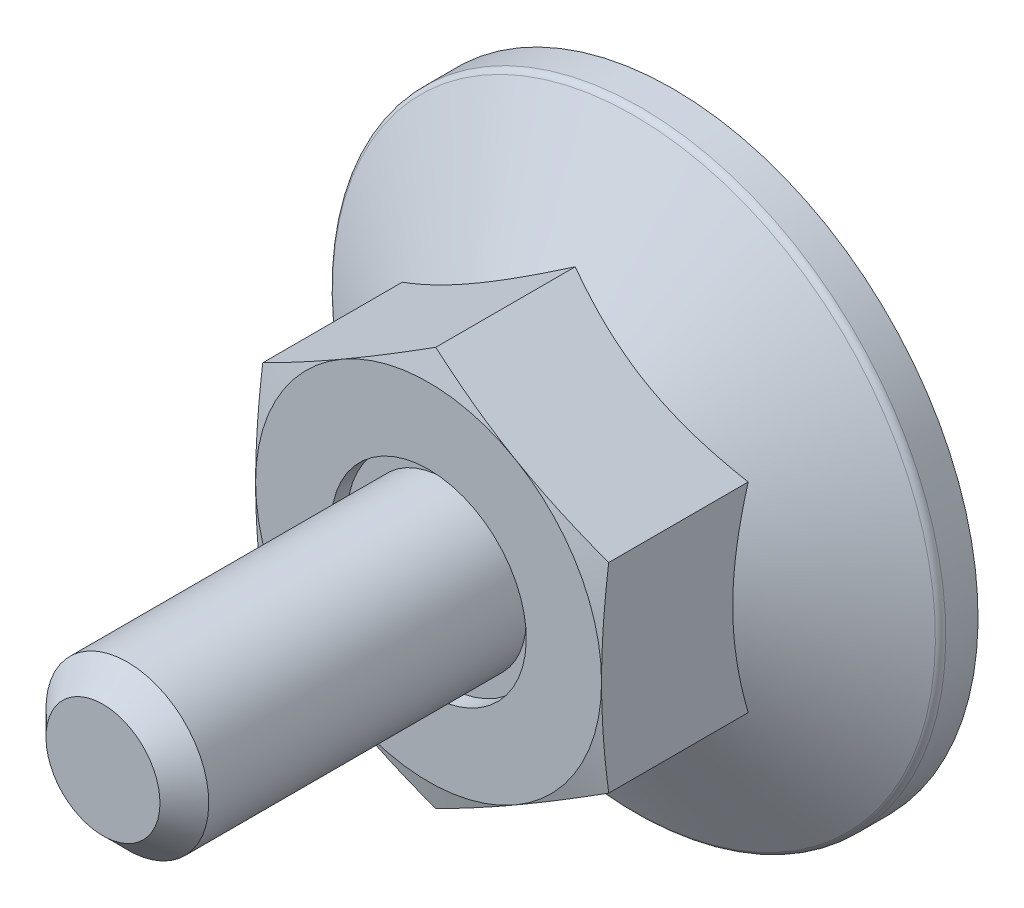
ISO-10303-21;
HEADER;
FILE_DESCRIPTION(('STEP AP214'),'2;1');
FILE_NAME('part.step','',(''),(''),'','','');
FILE_SCHEMA(('AUTOMOTIVE_DESIGN { 1 0 10303 214 1 1 1 1 }'));
ENDSEC;
DATA;
#1=APPLICATION_CONTEXT('core data for automotive mechanical design processes');
#2=APPLICATION_PROTOCOL_DEFINITION('international standard','automotive_design',2000,#1);
#3=PRODUCT_CONTEXT('',#1,'mechanical');
#4=PRODUCT('Part','Part','',(#3));
#5=PRODUCT_RELATED_PRODUCT_CATEGORY('part','',(#4));
#6=PRODUCT_DEFINITION_FORMATION('','',#4);
#7=PRODUCT_DEFINITION_CONTEXT('part definition',#1,'design');
#8=PRODUCT_DEFINITION('design','',#6,#7);
#9=PRODUCT_DEFINITION_SHAPE('','',#8);
#10=(LENGTH_UNIT() NAMED_UNIT(*) SI_UNIT(.MILLI.,.METRE.));
#11=(NAMED_UNIT(*) PLANE_ANGLE_UNIT() SI_UNIT($,.RADIAN.));
#12=(NAMED_UNIT(*) SI_UNIT($,.STERADIAN.) SOLID_ANGLE_UNIT());
#13=UNCERTAINTY_MEASURE_WITH_UNIT(LENGTH_MEASURE(1.E-05),#10,'distance_accuracy_value','');
#14=(GEOMETRIC_REPRESENTATION_CONTEXT(3) GLOBAL_UNCERTAINTY_ASSIGNED_CONTEXT((#13)) GLOBAL_UNIT_ASSIGNED_CONTEXT((#10,
#11,#12)) REPRESENTATION_CONTEXT('',''));
#15=CARTESIAN_POINT('',(0.,0.,0.));
#16=DIRECTION('',(0.,0.,1.));
#17=DIRECTION('',(1.,0.,0.));
#18=AXIS2_PLACEMENT_3D('',#15,#16,#17);
#19=CARTESIAN_POINT('',(0.,0.,11.2));
#20=DIRECTION('',(0.,0.,-1.));
#21=DIRECTION('',(0.,1.,0.));
#22=AXIS2_PLACEMENT_3D('',#19,#20,#21);
#23=PLANE('',#22);
#24=CARTESIAN_POINT('',(0.,0.,11.2));
#25=DIRECTION('',(0.,0.,-1.));
#26=DIRECTION('',(0.,1.,0.));
#27=AXIS2_PLACEMENT_3D('',#24,#25,#26);
#28=CIRCLE('',#27,4.8);
#29=CARTESIAN_POINT('',(0.,4.8,11.2));
#30=VERTEX_POINT('',#29);
#31=EDGE_CURVE('E108',#30,#30,#28,.T.);
#32=ORIENTED_EDGE('',*,*,#31,.F.);
#33=EDGE_LOOP('',(#32));
#34=FACE_BOUND('',#33,.T.);
#35=CARTESIAN_POINT('',(0.,0.,11.2));
#36=DIRECTION('',(0.,0.,-1.));
#37=DIRECTION('',(0.,1.,0.));
#38=AXIS2_PLACEMENT_3D('',#35,#36,#37);
#39=CIRCLE('',#38,4.);
#40=CARTESIAN_POINT('',(0.,4.,11.2));
#41=VERTEX_POINT('',#40);
#42=EDGE_CURVE('E259',#41,#41,#39,.F.);
#43=ORIENTED_EDGE('',*,*,#42,.F.);
#44=EDGE_LOOP('',(#43));
#45=FACE_BOUND('',#44,.T.);
#46=ADVANCED_FACE('F14',(#34,#45),#23,.F.);
#47=CARTESIAN_POINT('',(0.,9.81495457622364,32.));
#48=DIRECTION('',(0.5,-0.866025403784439,0.));
#49=DIRECTION('',(0.866025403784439,0.5,0.));
#50=AXIS2_PLACEMENT_3D('',#47,#48,#49);
#51=PLANE('',#50);
#52=CARTESIAN_POINT('',(-8.5002,4.90736181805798,4.7935207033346));
#53=CARTESIAN_POINT('',(-8.31336077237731,5.01523349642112,4.85579061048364));
#54=CARTESIAN_POINT('',(-8.1258249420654,5.1235073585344,4.91523445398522));
#55=CARTESIAN_POINT('',(-7.74923024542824,5.34093440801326,5.02769163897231));
#56=CARTESIAN_POINT('',(-7.56017075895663,5.45008795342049,5.08070220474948));
#57=CARTESIAN_POINT('',(-6.9899652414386,5.77929626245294,5.22904336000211));
#58=CARTESIAN_POINT('',(-6.60656835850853,6.00065055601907,5.31341782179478));
#59=CARTESIAN_POINT('',(-6.03282233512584,6.33190297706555,5.41235673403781));
#60=CARTESIAN_POINT('',(-5.84418723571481,6.44081150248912,5.44054155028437));
#61=CARTESIAN_POINT('',(-5.46606397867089,6.65912106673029,5.48780266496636));
#62=CARTESIAN_POINT('',(-5.27657589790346,6.76852206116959,5.5068797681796));
#63=CARTESIAN_POINT('',(-4.8972734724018,6.98751241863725,5.53544197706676));
#64=CARTESIAN_POINT('',(-4.70745974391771,7.09710142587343,5.54493796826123));
#65=CARTESIAN_POINT('',(-4.32765694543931,7.3163806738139,5.55413437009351));
#66=CARTESIAN_POINT('',(-4.13766788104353,7.42607091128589,5.55383508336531));
#67=CARTESIAN_POINT('',(-3.78247698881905,7.63114046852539,5.54412227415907));
#68=CARTESIAN_POINT('',(-3.6172500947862,7.72653426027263,5.53589358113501));
#69=CARTESIAN_POINT('',(-3.28718328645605,7.9170984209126,5.51218750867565));
#70=CARTESIAN_POINT('',(-3.12234339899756,8.01226877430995,5.49670964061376));
#71=CARTESIAN_POINT('',(-2.62846189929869,8.29741139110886,5.43976812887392));
#72=CARTESIAN_POINT('',(-2.30029449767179,8.48687892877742,5.38780368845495));
#73=CARTESIAN_POINT('',(-1.64047857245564,8.86782383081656,5.25789180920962));
#74=CARTESIAN_POINT('',(-1.30891425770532,9.05925257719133,5.17939367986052));
#75=CARTESIAN_POINT('',(-0.650730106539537,9.43925537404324,5.00123540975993));
#76=CARTESIAN_POINT('',(-0.32410184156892,9.62783429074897,4.90161711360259));
#77=CARTESIAN_POINT('',(0.000200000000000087,9.81507004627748,4.7935207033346));
#78=B_SPLINE_CURVE_WITH_KNOTS('',3,(#52,#53,#54,#55,#56,#57,#58,#59,#60,#61,#62,#63,#64,#65,#66,
#67,#68,#69,#70,#71,#72,#73,#74,#75,#76,#77),.UNSPECIFIED.,.F.,.F.,(4,2,2,2,2,2,2,2,2,2,2,2,4),
(0.,0.673596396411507,1.34748239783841,2.69805431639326,3.356799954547,4.01548737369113,
4.67342558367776,5.33134346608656,5.90409556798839,6.47688628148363,7.62328361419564,
8.79510569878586,9.9646274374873),.UNSPECIFIED.);
#79=CARTESIAN_POINT('',(-8.5,4.90747728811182,4.79358737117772));
#80=VERTEX_POINT('',#79);
#81=CARTESIAN_POINT('',(0.,9.81495457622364,4.79358737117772));
#82=VERTEX_POINT('',#81);
#83=EDGE_CURVE('E97',#80,#82,#78,.T.);
#84=ORIENTED_EDGE('',*,*,#83,.F.);
#85=DIRECTION('',(0.,0.,-1.));
#86=VECTOR('',#85,1.);
#87=CARTESIAN_POINT('',(-8.5,4.90747728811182,32.));
#88=LINE('',#87,#86);
#89=CARTESIAN_POINT('',(-8.5,4.90747728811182,11.6476589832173));
#90=VERTEX_POINT('',#89);
#91=EDGE_CURVE('E86',#90,#80,#88,.T.);
#92=ORIENTED_EDGE('',*,*,#91,.F.);
#93=CARTESIAN_POINT('',(0.000200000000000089,9.81507004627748,11.6476280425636));
#94=CARTESIAN_POINT('',(-0.352800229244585,9.61126526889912,11.7022599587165));
#95=CARTESIAN_POINT('',(-0.706440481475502,9.40709097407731,11.7518566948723));
#96=CARTESIAN_POINT('',(-1.41496987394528,8.99802133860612,11.8389934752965));
#97=CARTESIAN_POINT('',(-1.76985946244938,8.79312573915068,11.8765286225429));
#98=CARTESIAN_POINT('',(-2.47873586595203,8.38385575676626,11.9373509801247));
#99=CARTESIAN_POINT('',(-2.83271788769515,8.17948414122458,11.9607107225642));
#100=CARTESIAN_POINT('',(-3.5411333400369,7.77048028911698,11.9920337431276));
#101=CARTESIAN_POINT('',(-3.89556667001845,7.56584811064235,12.));
#102=CARTESIAN_POINT('',(-4.60443332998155,7.15658375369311,12.));
#103=CARTESIAN_POINT('',(-4.9588666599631,6.95195157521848,11.9920337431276));
#104=CARTESIAN_POINT('',(-5.66728211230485,6.54294772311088,11.9607107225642));
#105=CARTESIAN_POINT('',(-6.02126413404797,6.33857610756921,11.9373509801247));
#106=CARTESIAN_POINT('',(-6.73014053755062,5.92930612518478,11.8765286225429));
#107=CARTESIAN_POINT('',(-7.08503012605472,5.72441052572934,11.8389934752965));
#108=CARTESIAN_POINT('',(-7.7935595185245,5.31534089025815,11.7518566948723));
#109=CARTESIAN_POINT('',(-8.14719977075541,5.11116659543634,11.7022599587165));
#110=CARTESIAN_POINT('',(-8.5002,4.90736181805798,11.6476280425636));
#111=B_SPLINE_CURVE_WITH_KNOTS('',3,(#93,#94,#95,#96,#97,#98,#99,#100,#101,#102,#103,#104,#105,
#106,#107,#108,#109,#110),.UNSPECIFIED.,.F.,.F.,(4,2,2,2,2,2,2,2,4),(0.,1.23382789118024,
2.46815608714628,3.69611406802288,4.92383440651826,6.15155474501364,7.37951272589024,
8.61384092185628,9.84766881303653),.UNSPECIFIED.);
#112=CARTESIAN_POINT('',(-4.25,7.36121593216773,12.));
#113=VERTEX_POINT('',#112);
#114=EDGE_CURVE('E186',#113,#90,#111,.T.);
#115=ORIENTED_EDGE('',*,*,#114,.F.);
#116=CARTESIAN_POINT('',(0.,9.81495457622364,11.6476589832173));
#117=VERTEX_POINT('',#116);
#118=EDGE_CURVE('E318',#117,#113,#111,.T.);
#119=ORIENTED_EDGE('',*,*,#118,.F.);
#120=DIRECTION('',(0.,0.,-1.));
#121=VECTOR('',#120,1.);
#122=CARTESIAN_POINT('',(0.,9.81495457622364,32.));
#123=LINE('',#122,#121);
#124=EDGE_CURVE('E101',#117,#82,#123,.T.);
#125=ORIENTED_EDGE('',*,*,#124,.T.);
#126=EDGE_LOOP('',(#84,#92,#115,#119,#125));
#127=FACE_BOUND('',#126,.T.);
#128=ADVANCED_FACE('F100',(#127),#51,.F.);
#129=CARTESIAN_POINT('',(8.5,4.90747728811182,32.));
#130=DIRECTION('',(-0.5,-0.866025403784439,0.));
#131=DIRECTION('',(0.866025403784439,-0.5,0.));
#132=AXIS2_PLACEMENT_3D('',#129,#130,#131);
#133=PLANE('',#132);
#134=CARTESIAN_POINT('',(-0.0002,9.81507004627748,4.7935207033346));
#135=CARTESIAN_POINT('',(0.186639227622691,9.70719836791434,4.85579061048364));
#136=CARTESIAN_POINT('',(0.374175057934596,9.59892450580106,4.91523445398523));
#137=CARTESIAN_POINT('',(0.750769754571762,9.3814974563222,5.02769163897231));
#138=CARTESIAN_POINT('',(0.939829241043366,9.27234391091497,5.08070220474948));
#139=CARTESIAN_POINT('',(1.5100347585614,8.94313560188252,5.22904336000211));
#140=CARTESIAN_POINT('',(1.89343164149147,8.72178130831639,5.31341782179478));
#141=CARTESIAN_POINT('',(2.46717766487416,8.39052888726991,5.41235673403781));
#142=CARTESIAN_POINT('',(2.65581276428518,8.28162036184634,5.44054155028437));
#143=CARTESIAN_POINT('',(3.03393602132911,8.06331079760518,5.48780266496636));
#144=CARTESIAN_POINT('',(3.22342410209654,7.95390980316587,5.5068797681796));
#145=CARTESIAN_POINT('',(3.6027265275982,7.73491944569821,5.53544197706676));
#146=CARTESIAN_POINT('',(3.79254025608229,7.62533043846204,5.54493796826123));
#147=CARTESIAN_POINT('',(4.17234305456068,7.40605119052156,5.55413437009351));
#148=CARTESIAN_POINT('',(4.36233211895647,7.29636095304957,5.55383508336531));
#149=CARTESIAN_POINT('',(4.71752301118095,7.09129139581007,5.54412227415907));
#150=CARTESIAN_POINT('',(4.8827499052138,6.99589760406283,5.53589358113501));
#151=CARTESIAN_POINT('',(5.21281671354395,6.80533344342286,5.51218750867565));
#152=CARTESIAN_POINT('',(5.37765660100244,6.71016309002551,5.49670964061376));
#153=CARTESIAN_POINT('',(5.87153810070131,6.42502047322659,5.43976812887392));
#154=CARTESIAN_POINT('',(6.19970550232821,6.23555293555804,5.38780368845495));
#155=CARTESIAN_POINT('',(6.85952142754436,5.8546080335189,5.25789180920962));
#156=CARTESIAN_POINT('',(7.19108574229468,5.66317928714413,5.17939367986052));
#157=CARTESIAN_POINT('',(7.84926989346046,5.28317649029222,5.00123540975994));
#158=CARTESIAN_POINT('',(8.17589815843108,5.09459757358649,4.90161711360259));
#159=CARTESIAN_POINT('',(8.5002,4.90736181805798,4.7935207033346));
#160=B_SPLINE_CURVE_WITH_KNOTS('',3,(#134,#135,#136,#137,#138,#139,#140,#141,#142,#143,#144,
#145,#146,#147,#148,#149,#150,#151,#152,#153,#154,#155,#156,#157,#158,#159),.UNSPECIFIED.,.F.,
.F.,(4,2,2,2,2,2,2,2,2,2,2,2,4),(0.,0.673596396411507,1.34748239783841,2.69805431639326,
3.356799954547,4.01548737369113,4.67342558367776,5.33134346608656,5.90409556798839,
6.47688628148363,7.62328361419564,8.79510569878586,9.9646274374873),.UNSPECIFIED.);
#161=CARTESIAN_POINT('',(8.5,4.90747728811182,4.79358737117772));
#162=VERTEX_POINT('',#161);
#163=EDGE_CURVE('E29',#82,#162,#160,.T.);
#164=ORIENTED_EDGE('',*,*,#163,.F.);
#165=ORIENTED_EDGE('',*,*,#124,.F.);
#166=CARTESIAN_POINT('',(8.5002,4.90736181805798,11.6476280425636));
#167=CARTESIAN_POINT('',(8.14719977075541,5.11116659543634,11.7022599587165));
#168=CARTESIAN_POINT('',(7.7935595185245,5.31534089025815,11.7518566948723));
#169=CARTESIAN_POINT('',(7.08503012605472,5.72441052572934,11.8389934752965));
#170=CARTESIAN_POINT('',(6.73014053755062,5.92930612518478,11.8765286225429));
#171=CARTESIAN_POINT('',(6.02126413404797,6.33857610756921,11.9373509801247));
#172=CARTESIAN_POINT('',(5.66728211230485,6.54294772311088,11.9607107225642));
#173=CARTESIAN_POINT('',(4.9588666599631,6.95195157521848,11.9920337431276));
#174=CARTESIAN_POINT('',(4.60443332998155,7.15658375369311,12.));
#175=CARTESIAN_POINT('',(3.89556667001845,7.56584811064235,12.));
#176=CARTESIAN_POINT('',(3.5411333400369,7.77048028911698,11.9920337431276));
#177=CARTESIAN_POINT('',(2.83271788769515,8.17948414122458,11.9607107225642));
#178=CARTESIAN_POINT('',(2.47873586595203,8.38385575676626,11.9373509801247));
#179=CARTESIAN_POINT('',(1.76985946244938,8.79312573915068,11.8765286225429));
#180=CARTESIAN_POINT('',(1.41496987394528,8.99802133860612,11.8389934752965));
#181=CARTESIAN_POINT('',(0.706440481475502,9.40709097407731,11.7518566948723));
#182=CARTESIAN_POINT('',(0.352800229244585,9.61126526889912,11.7022599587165));
#183=CARTESIAN_POINT('',(-0.000200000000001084,9.81507004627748,11.6476280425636));
#184=B_SPLINE_CURVE_WITH_KNOTS('',3,(#166,#167,#168,#169,#170,#171,#172,#173,#174,#175,#176,
#177,#178,#179,#180,#181,#182,#183),.UNSPECIFIED.,.F.,.F.,(4,2,2,2,2,2,2,2,4),(0.,
1.23382789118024,2.46815608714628,3.69611406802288,4.92383440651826,6.15155474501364,
7.37951272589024,8.61384092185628,9.84766881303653),.UNSPECIFIED.);
#185=CARTESIAN_POINT('',(4.25,7.36121593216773,12.));
#186=VERTEX_POINT('',#185);
#187=EDGE_CURVE('E177',#186,#117,#184,.T.);
#188=ORIENTED_EDGE('',*,*,#187,.F.);
#189=CARTESIAN_POINT('',(8.5,4.90747728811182,11.6476589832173));
#190=VERTEX_POINT('',#189);
#191=EDGE_CURVE('E184',#190,#186,#184,.T.);
#192=ORIENTED_EDGE('',*,*,#191,.F.);
#193=DIRECTION('',(0.,0.,-1.));
#194=VECTOR('',#193,1.);
#195=CARTESIAN_POINT('',(8.5,4.90747728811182,32.));
#196=LINE('',#195,#194);
#197=EDGE_CURVE('E216',#190,#162,#196,.T.);
#198=ORIENTED_EDGE('',*,*,#197,.T.);
#199=EDGE_LOOP('',(#164,#165,#188,#192,#198));
#200=FACE_BOUND('',#199,.T.);
#201=ADVANCED_FACE('F192',(#200),#133,.F.);
#202=CARTESIAN_POINT('',(8.5,-4.90747728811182,32.));
#203=DIRECTION('',(-1.,0.,0.));
#204=DIRECTION('',(0.,-1.,0.));
#205=AXIS2_PLACEMENT_3D('',#202,#203,#204);
#206=PLANE('',#205);
#207=CARTESIAN_POINT('',(8.5,13.0314294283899,1.47752704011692));
#208=CARTESIAN_POINT('',(8.5,12.6612665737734,1.65647774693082));
#209=CARTESIAN_POINT('',(8.5,12.290237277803,1.83366776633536));
#210=CARTESIAN_POINT('',(8.5,11.5459841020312,2.1835324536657));
#211=CARTESIAN_POINT('',(8.5,11.1727598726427,2.3562063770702));
#212=CARTESIAN_POINT('',(8.5,10.4216603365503,2.69694543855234));
#213=CARTESIAN_POINT('',(8.5,10.0437706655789,2.86497902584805));
#214=CARTESIAN_POINT('',(8.5,9.2849306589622,3.19396010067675));
#215=CARTESIAN_POINT('',(8.5,8.90398047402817,3.35490793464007));
#216=CARTESIAN_POINT('',(8.5,8.12702308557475,3.67249615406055));
#217=CARTESIAN_POINT('',(8.5,7.73090483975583,3.82886642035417));
#218=CARTESIAN_POINT('',(8.5,6.93398073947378,4.12940330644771));
#219=CARTESIAN_POINT('',(8.5,6.53317435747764,4.27356853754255));
#220=CARTESIAN_POINT('',(8.5,5.72703031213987,4.54580160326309));
#221=CARTESIAN_POINT('',(8.5,5.32170421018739,4.67390329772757));
#222=CARTESIAN_POINT('',(8.5,4.50525785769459,4.90980359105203));
#223=CARTESIAN_POINT('',(8.5,4.09413952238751,5.01760873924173));
#224=CARTESIAN_POINT('',(8.5,3.26789885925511,5.20711197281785));
#225=CARTESIAN_POINT('',(8.5,2.85280627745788,5.28893618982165));
#226=CARTESIAN_POINT('',(8.5,2.22651264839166,5.38853539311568));
#227=CARTESIAN_POINT('',(8.5,2.01712321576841,5.41788026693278));
#228=CARTESIAN_POINT('',(8.5,1.59735566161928,5.46827917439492));
#229=CARTESIAN_POINT('',(8.5,1.38697763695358,5.48933400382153));
#230=CARTESIAN_POINT('',(8.5,0.968196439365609,5.52247691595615));
#231=CARTESIAN_POINT('',(8.5,0.759802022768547,5.53467524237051));
#232=CARTESIAN_POINT('',(8.5,0.342684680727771,5.55026003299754));
#233=CARTESIAN_POINT('',(8.5,0.133961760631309,5.5536466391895));
#234=CARTESIAN_POINT('',(8.5,-0.283445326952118,5.55152742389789));
#235=CARTESIAN_POINT('',(8.5,-0.492129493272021,5.546021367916));
#236=CARTESIAN_POINT('',(8.5,-0.909085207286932,5.52624824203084));
#237=CARTESIAN_POINT('',(8.5,-1.11735673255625,5.51198070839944));
#238=CARTESIAN_POINT('',(8.5,-1.62231800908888,5.46706351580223));
#239=CARTESIAN_POINT('',(8.5,-1.91862399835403,5.43201243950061));
#240=CARTESIAN_POINT('',(8.5,-2.50892471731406,5.34612267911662));
#241=CARTESIAN_POINT('',(8.5,-2.80291910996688,5.29528173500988));
#242=CARTESIAN_POINT('',(8.5,-3.68114216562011,5.12178025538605));
#243=CARTESIAN_POINT('',(8.5,-4.26128126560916,4.97817413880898));
#244=CARTESIAN_POINT('',(8.5,-5.12903133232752,4.73045572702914));
#245=CARTESIAN_POINT('',(8.5,-5.42116721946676,4.64129591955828));
#246=CARTESIAN_POINT('',(8.5,-6.0025970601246,4.45406394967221));
#247=CARTESIAN_POINT('',(8.5,-6.29189099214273,4.35599171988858));
#248=CARTESIAN_POINT('',(8.5,-6.86774141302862,4.15248019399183));
#249=CARTESIAN_POINT('',(8.5,-7.15429879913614,4.0470434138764));
#250=CARTESIAN_POINT('',(8.5,-7.72505625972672,3.83000899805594));
#251=CARTESIAN_POINT('',(8.5,-8.00925638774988,3.71841150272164));
#252=CARTESIAN_POINT('',(8.5,-8.7865968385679,3.40502511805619));
#253=CARTESIAN_POINT('',(8.5,-9.2776226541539,3.197996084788));
#254=CARTESIAN_POINT('',(8.5,-10.2546964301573,2.77246752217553));
#255=CARTESIAN_POINT('',(8.5,-10.7407438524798,2.55396676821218));
#256=CARTESIAN_POINT('',(8.5,-11.7090438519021,2.108282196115));
#257=CARTESIAN_POINT('',(8.5,-12.1912949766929,1.88109523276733));
#258=CARTESIAN_POINT('',(8.5,-13.1526185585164,1.42016244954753));
#259=CARTESIAN_POINT('',(8.5,-13.6316911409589,1.18641689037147));
#260=CARTESIAN_POINT('',(8.5,-14.588034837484,0.713462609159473));
#261=CARTESIAN_POINT('',(8.5,-15.0653020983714,0.47424611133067));
#262=CARTESIAN_POINT('',(8.5,-16.0177905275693,-0.00822936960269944));
#263=CARTESIAN_POINT('',(8.5,-16.4930116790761,-0.251488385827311));
#264=CARTESIAN_POINT('',(8.5,-17.4416812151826,-0.741191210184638));
#265=CARTESIAN_POINT('',(8.5,-17.9151299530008,-0.987634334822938));
#266=CARTESIAN_POINT('',(8.5,-18.8606492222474,-1.48315179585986));
#267=CARTESIAN_POINT('',(8.5,-19.3327197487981,-1.73222614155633));
#268=CARTESIAN_POINT('',(8.5,-20.6461392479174,-2.42904815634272));
#269=CARTESIAN_POINT('',(8.5,-21.4862394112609,-2.87914918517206));
#270=CARTESIAN_POINT('',(8.5,-23.1638169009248,-3.78432075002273));
#271=CARTESIAN_POINT('',(8.5,-24.0012940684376,-4.23939157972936));
#272=CARTESIAN_POINT('',(8.5,-25.671623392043,-5.15180725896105));
#273=CARTESIAN_POINT('',(8.5,-26.5044818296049,-5.60914061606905));
#274=CARTESIAN_POINT('',(8.5,-27.7525740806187,-6.29723391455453));
#275=CARTESIAN_POINT('',(8.5,-28.1683903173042,-6.52693873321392));
#276=CARTESIAN_POINT('',(8.5,-28.9996764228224,-6.98697325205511));
#277=CARTESIAN_POINT('',(8.5,-29.4151462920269,-7.21730295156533));
#278=CARTESIAN_POINT('',(8.5,-29.8304643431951,-7.44790614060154));
#279=B_SPLINE_CURVE_WITH_KNOTS('',3,(#207,#208,#209,#210,#211,#212,#213,#214,#215,#216,#217,
#218,#219,#220,#221,#222,#223,#224,#225,#226,#227,#228,#229,#230,#231,#232,#233,#234,#235,#236,
#237,#238,#239,#240,#241,#242,#243,#244,#245,#246,#247,#248,#249,#250,#251,#252,#253,#254,#255,
#256,#257,#258,#259,#260,#261,#262,#263,#264,#265,#266,#267,#268,#269,#270,#271,#272,#273,#274,
#275,#276,#277,#278),.UNSPECIFIED.,.F.,.F.,(4,2,2,2,2,2,2,2,2,2,2,2,2,2,2,2,2,2,2,2,2,2,2,2,2,2,
2,2,2,2,2,2,2,2,2,4),(0.,1.23346428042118,2.46713064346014,3.70776702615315,4.94834268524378,
6.22578289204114,7.5033682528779,8.77821366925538,10.0526470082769,11.32079515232,
11.9549638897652,12.5890717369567,13.2151443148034,13.8412068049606,14.4672858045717,
15.0933979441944,15.9880059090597,16.8827419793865,18.6732029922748,19.5894472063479,
20.5056983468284,21.4216379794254,22.3375567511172,23.9359919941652,25.5345982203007,
27.1337888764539,28.7329160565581,30.3344778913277,31.9360528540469,33.5372895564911,
35.1385319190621,37.9977422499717,40.8571224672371,43.7075995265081,45.1327331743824,
46.5578652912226),.UNSPECIFIED.);
#280=CARTESIAN_POINT('',(8.5,-4.90747728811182,4.79358737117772));
#281=VERTEX_POINT('',#280);
#282=EDGE_CURVE('E37',#162,#281,#279,.T.);
#283=ORIENTED_EDGE('',*,*,#282,.F.);
#284=ORIENTED_EDGE('',*,*,#197,.F.);
#285=CARTESIAN_POINT('',(8.5,12.9820891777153,10.1197370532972));
#286=CARTESIAN_POINT('',(8.5,12.5964686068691,10.2061594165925));
#287=CARTESIAN_POINT('',(8.5,12.2106068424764,10.2915248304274));
#288=CARTESIAN_POINT('',(8.5,11.4382824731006,10.4595712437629));
#289=CARTESIAN_POINT('',(8.5,11.0518198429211,10.5422521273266));
#290=CARTESIAN_POINT('',(8.5,10.2778290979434,10.7044309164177));
#291=CARTESIAN_POINT('',(8.5,9.89030030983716,10.7839256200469));
#292=CARTESIAN_POINT('',(8.5,9.11443612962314,10.9388739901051));
#293=CARTESIAN_POINT('',(8.5,8.72610074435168,11.0143276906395));
#294=CARTESIAN_POINT('',(8.5,7.95158013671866,11.159650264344));
#295=CARTESIAN_POINT('',(8.5,7.56540239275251,11.2295587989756));
#296=CARTESIAN_POINT('',(8.5,6.79199352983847,11.3632725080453));
#297=CARTESIAN_POINT('',(8.5,6.40476243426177,11.4270778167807));
#298=CARTESIAN_POINT('',(8.5,5.62917169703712,11.54714843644));
#299=CARTESIAN_POINT('',(8.5,5.24081220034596,11.6034146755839));
#300=CARTESIAN_POINT('',(8.5,4.46285737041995,11.70674908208));
#301=CARTESIAN_POINT('',(8.5,4.07326203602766,11.7538172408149));
#302=CARTESIAN_POINT('',(8.5,3.28844017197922,11.8374226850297));
#303=CARTESIAN_POINT('',(8.5,2.89320002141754,11.8738340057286));
#304=CARTESIAN_POINT('',(8.5,2.10172608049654,11.9336139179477));
#305=CARTESIAN_POINT('',(8.5,1.70549231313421,11.9569828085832));
#306=CARTESIAN_POINT('',(8.5,0.91260591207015,11.9893148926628));
#307=CARTESIAN_POINT('',(8.5,0.515953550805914,11.9982846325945));
#308=CARTESIAN_POINT('',(8.5,-0.277408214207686,12.0012669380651));
#309=CARTESIAN_POINT('',(8.5,-0.674117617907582,11.9952795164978));
#310=CARTESIAN_POINT('',(8.5,-1.46847963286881,11.9686842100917));
#311=CARTESIAN_POINT('',(8.5,-1.86613043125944,11.9480232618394));
#312=CARTESIAN_POINT('',(8.5,-2.66049684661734,11.8932602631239));
#313=CARTESIAN_POINT('',(8.5,-3.05721244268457,11.8591579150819));
#314=CARTESIAN_POINT('',(8.5,-3.84970511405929,11.7792347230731));
#315=CARTESIAN_POINT('',(8.5,-4.24548140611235,11.7334062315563));
#316=CARTESIAN_POINT('',(8.5,-5.03576028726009,11.6319377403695));
#317=CARTESIAN_POINT('',(8.5,-5.43026287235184,11.5762977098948));
#318=CARTESIAN_POINT('',(8.5,-6.19195385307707,11.4609360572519));
#319=CARTESIAN_POINT('',(8.5,-6.55922094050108,11.4017287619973));
#320=CARTESIAN_POINT('',(8.5,-7.29278719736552,11.2775674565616));
#321=CARTESIAN_POINT('',(8.5,-7.65908634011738,11.2126132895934));
#322=CARTESIAN_POINT('',(8.5,-8.39085027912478,11.078008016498));
#323=CARTESIAN_POINT('',(8.5,-8.75631499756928,11.0083564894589));
#324=CARTESIAN_POINT('',(8.5,-9.48649515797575,10.8652200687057));
#325=CARTESIAN_POINT('',(8.5,-9.85121059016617,10.7917351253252));
#326=CARTESIAN_POINT('',(8.5,-10.5800753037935,10.6416087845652));
#327=CARTESIAN_POINT('',(8.5,-10.944224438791,10.5649666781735));
#328=CARTESIAN_POINT('',(8.5,-11.6719684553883,10.4090909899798));
#329=CARTESIAN_POINT('',(8.5,-12.0355633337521,10.3298573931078));
#330=CARTESIAN_POINT('',(8.5,-13.1255915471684,10.0889686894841));
#331=CARTESIAN_POINT('',(8.5,-13.8513178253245,9.92411536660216));
#332=CARTESIAN_POINT('',(8.5,-15.2942598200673,9.59010912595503));
#333=CARTESIAN_POINT('',(8.5,-16.0114890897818,9.42101437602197));
#334=CARTESIAN_POINT('',(8.5,-17.4449475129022,9.07858755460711));
#335=CARTESIAN_POINT('',(8.5,-18.1611766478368,8.90525540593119));
#336=CARTESIAN_POINT('',(8.5,-19.5919856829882,8.5556799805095));
#337=CARTESIAN_POINT('',(8.5,-20.306566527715,8.37944056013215));
#338=CARTESIAN_POINT('',(8.5,-21.7351057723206,8.02455520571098));
#339=CARTESIAN_POINT('',(8.5,-22.4490641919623,7.8459093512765));
#340=CARTESIAN_POINT('',(8.5,-23.1628057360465,7.66641079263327));
#341=B_SPLINE_CURVE_WITH_KNOTS('',3,(#285,#286,#287,#288,#289,#290,#291,#292,#293,#294,#295,
#296,#297,#298,#299,#300,#301,#302,#303,#304,#305,#306,#307,#308,#309,#310,#311,#312,#313,#314,
#315,#316,#317,#318,#319,#320,#321,#322,#323,#324,#325,#326,#327,#328,#329,#330,#331,#332,#333,
#334,#335,#336,#337,#338,#339,#340),.UNSPECIFIED.,.F.,.F.,(4,2,2,2,2,2,2,2,2,2,2,2,2,2,2,2,2,2,
2,2,2,2,2,2,2,2,2,4),(0.,1.18556310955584,2.37117735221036,3.55795462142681,4.74472187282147,
5.92204594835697,7.09934411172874,8.27649719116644,9.45365137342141,10.6442044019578,
11.8347301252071,13.0247144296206,14.2146977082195,15.4090063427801,16.6033414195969,
17.7984574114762,18.9935771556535,20.1095500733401,21.2255534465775,22.3416569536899,
23.4577749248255,24.5741449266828,25.6905214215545,27.9231231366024,30.1337863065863,
32.3444897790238,34.5524651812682,36.7603677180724),.UNSPECIFIED.);
#342=CARTESIAN_POINT('',(8.5,0.,12.));
#343=VERTEX_POINT('',#342);
#344=EDGE_CURVE('E170',#343,#190,#341,.F.);
#345=ORIENTED_EDGE('',*,*,#344,.F.);
#346=CARTESIAN_POINT('',(8.5,-4.90747728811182,11.6476589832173));
#347=VERTEX_POINT('',#346);
#348=EDGE_CURVE('E185',#347,#343,#341,.F.);
#349=ORIENTED_EDGE('',*,*,#348,.F.);
#350=DIRECTION('',(0.,0.,-1.));
#351=VECTOR('',#350,1.);
#352=CARTESIAN_POINT('',(8.5,-4.90747728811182,32.));
#353=LINE('',#352,#351);
#354=EDGE_CURVE('E218',#347,#281,#353,.T.);
#355=ORIENTED_EDGE('',*,*,#354,.T.);
#356=EDGE_LOOP('',(#283,#284,#345,#349,#355));
#357=FACE_BOUND('',#356,.T.);
#358=ADVANCED_FACE('F195',(#357),#206,.F.);
#359=CARTESIAN_POINT('',(0.,-9.81495457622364,32.));
#360=DIRECTION('',(-0.5,0.866025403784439,0.));
#361=DIRECTION('',(-0.866025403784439,-0.5,0.));
#362=AXIS2_PLACEMENT_3D('',#359,#360,#361);
#363=PLANE('',#362);
#364=CARTESIAN_POINT('',(8.5002,-4.90736181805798,4.7935207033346));
#365=CARTESIAN_POINT('',(8.31336077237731,-5.01523349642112,4.85579061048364));
#366=CARTESIAN_POINT('',(8.1258249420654,-5.1235073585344,4.91523445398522));
#367=CARTESIAN_POINT('',(7.74923024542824,-5.34093440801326,5.02769163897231));
#368=CARTESIAN_POINT('',(7.56017075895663,-5.45008795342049,5.08070220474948));
#369=CARTESIAN_POINT('',(6.9899652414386,-5.77929626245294,5.22904336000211));
#370=CARTESIAN_POINT('',(6.60656835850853,-6.00065055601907,5.31341782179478));
#371=CARTESIAN_POINT('',(6.03282233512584,-6.33190297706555,5.41235673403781));
#372=CARTESIAN_POINT('',(5.84418723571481,-6.44081150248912,5.44054155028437));
#373=CARTESIAN_POINT('',(5.46606397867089,-6.65912106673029,5.48780266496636));
#374=CARTESIAN_POINT('',(5.27657589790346,-6.76852206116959,5.5068797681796));
#375=CARTESIAN_POINT('',(4.8972734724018,-6.98751241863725,5.53544197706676));
#376=CARTESIAN_POINT('',(4.70745974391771,-7.09710142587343,5.54493796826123));
#377=CARTESIAN_POINT('',(4.32765694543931,-7.3163806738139,5.55413437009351));
#378=CARTESIAN_POINT('',(4.13766788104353,-7.42607091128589,5.55383508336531));
#379=CARTESIAN_POINT('',(3.78247698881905,-7.63114046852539,5.54412227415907));
#380=CARTESIAN_POINT('',(3.6172500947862,-7.72653426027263,5.53589358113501));
#381=CARTESIAN_POINT('',(3.28718328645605,-7.9170984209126,5.51218750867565));
#382=CARTESIAN_POINT('',(3.12234339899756,-8.01226877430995,5.49670964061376));
#383=CARTESIAN_POINT('',(2.62846189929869,-8.29741139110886,5.43976812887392));
#384=CARTESIAN_POINT('',(2.30029449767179,-8.48687892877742,5.38780368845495));
#385=CARTESIAN_POINT('',(1.64047857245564,-8.86782383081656,5.25789180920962));
#386=CARTESIAN_POINT('',(1.30891425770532,-9.05925257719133,5.17939367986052));
#387=CARTESIAN_POINT('',(0.650730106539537,-9.43925537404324,5.00123540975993));
#388=CARTESIAN_POINT('',(0.32410184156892,-9.62783429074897,4.90161711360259));
#389=CARTESIAN_POINT('',(-0.000200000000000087,-9.81507004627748,4.7935207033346));
#390=B_SPLINE_CURVE_WITH_KNOTS('',3,(#364,#365,#366,#367,#368,#369,#370,#371,#372,#373,#374,
#375,#376,#377,#378,#379,#380,#381,#382,#383,#384,#385,#386,#387,#388,#389),.UNSPECIFIED.,.F.,
.F.,(4,2,2,2,2,2,2,2,2,2,2,2,4),(0.,0.673596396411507,1.34748239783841,2.69805431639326,
3.356799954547,4.01548737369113,4.67342558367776,5.33134346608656,5.90409556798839,
6.47688628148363,7.62328361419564,8.79510569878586,9.9646274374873),.UNSPECIFIED.);
#391=CARTESIAN_POINT('',(0.,-9.81495457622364,4.79358737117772));
#392=VERTEX_POINT('',#391);
#393=EDGE_CURVE('E276',#281,#392,#390,.T.);
#394=ORIENTED_EDGE('',*,*,#393,.F.);
#395=ORIENTED_EDGE('',*,*,#354,.F.);
#396=CARTESIAN_POINT('',(-0.000200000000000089,-9.81507004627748,11.6476280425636));
#397=CARTESIAN_POINT('',(0.352800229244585,-9.61126526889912,11.7022599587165));
#398=CARTESIAN_POINT('',(0.706440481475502,-9.40709097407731,11.7518566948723));
#399=CARTESIAN_POINT('',(1.41496987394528,-8.99802133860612,11.8389934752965));
#400=CARTESIAN_POINT('',(1.76985946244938,-8.79312573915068,11.8765286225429));
#401=CARTESIAN_POINT('',(2.47873586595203,-8.38385575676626,11.9373509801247));
#402=CARTESIAN_POINT('',(2.83271788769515,-8.17948414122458,11.9607107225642));
#403=CARTESIAN_POINT('',(3.5411333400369,-7.77048028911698,11.9920337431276));
#404=CARTESIAN_POINT('',(3.89556667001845,-7.56584811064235,12.));
#405=CARTESIAN_POINT('',(4.60443332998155,-7.15658375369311,12.));
#406=CARTESIAN_POINT('',(4.9588666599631,-6.95195157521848,11.9920337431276));
#407=CARTESIAN_POINT('',(5.66728211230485,-6.54294772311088,11.9607107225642));
#408=CARTESIAN_POINT('',(6.02126413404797,-6.33857610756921,11.9373509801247));
#409=CARTESIAN_POINT('',(6.73014053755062,-5.92930612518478,11.8765286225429));
#410=CARTESIAN_POINT('',(7.08503012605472,-5.72441052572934,11.8389934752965));
#411=CARTESIAN_POINT('',(7.7935595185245,-5.31534089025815,11.7518566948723));
#412=CARTESIAN_POINT('',(8.14719977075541,-5.11116659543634,11.7022599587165));
#413=CARTESIAN_POINT('',(8.5002,-4.90736181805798,11.6476280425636));
#414=B_SPLINE_CURVE_WITH_KNOTS('',3,(#396,#397,#398,#399,#400,#401,#402,#403,#404,#405,#406,
#407,#408,#409,#410,#411,#412,#413),.UNSPECIFIED.,.F.,.F.,(4,2,2,2,2,2,2,2,4),(0.,
1.23382789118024,2.46815608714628,3.69611406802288,4.92383440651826,6.15155474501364,
7.37951272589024,8.61384092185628,9.84766881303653),.UNSPECIFIED.);
#415=CARTESIAN_POINT('',(4.25,-7.36121593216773,12.));
#416=VERTEX_POINT('',#415);
#417=EDGE_CURVE('E164',#416,#347,#414,.T.);
#418=ORIENTED_EDGE('',*,*,#417,.F.);
#419=CARTESIAN_POINT('',(0.,-9.81495457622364,11.6476589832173));
#420=VERTEX_POINT('',#419);
#421=EDGE_CURVE('E299',#420,#416,#414,.T.);
#422=ORIENTED_EDGE('',*,*,#421,.F.);
#423=DIRECTION('',(0.,0.,-1.));
#424=VECTOR('',#423,1.);
#425=CARTESIAN_POINT('',(0.,-9.81495457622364,32.));
#426=LINE('',#425,#424);
#427=EDGE_CURVE('E220',#420,#392,#426,.T.);
#428=ORIENTED_EDGE('',*,*,#427,.T.);
#429=EDGE_LOOP('',(#394,#395,#418,#422,#428));
#430=FACE_BOUND('',#429,.T.);
#431=ADVANCED_FACE('F281',(#430),#363,.F.);
#432=CARTESIAN_POINT('',(-8.5,-4.90747728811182,32.));
#433=DIRECTION('',(0.5,0.866025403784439,0.));
#434=DIRECTION('',(-0.866025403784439,0.5,0.));
#435=AXIS2_PLACEMENT_3D('',#432,#433,#434);
#436=PLANE('',#435);
#437=CARTESIAN_POINT('',(0.0002,-9.81507004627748,4.7935207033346));
#438=CARTESIAN_POINT('',(-0.186639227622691,-9.70719836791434,4.85579061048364));
#439=CARTESIAN_POINT('',(-0.374175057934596,-9.59892450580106,4.91523445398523));
#440=CARTESIAN_POINT('',(-0.750769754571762,-9.3814974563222,5.02769163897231));
#441=CARTESIAN_POINT('',(-0.939829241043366,-9.27234391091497,5.08070220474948));
#442=CARTESIAN_POINT('',(-1.5100347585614,-8.94313560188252,5.22904336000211));
#443=CARTESIAN_POINT('',(-1.89343164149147,-8.72178130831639,5.31341782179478));
#444=CARTESIAN_POINT('',(-2.46717766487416,-8.39052888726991,5.41235673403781));
#445=CARTESIAN_POINT('',(-2.65581276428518,-8.28162036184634,5.44054155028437));
#446=CARTESIAN_POINT('',(-3.03393602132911,-8.06331079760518,5.48780266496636));
#447=CARTESIAN_POINT('',(-3.22342410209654,-7.95390980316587,5.5068797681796));
#448=CARTESIAN_POINT('',(-3.6027265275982,-7.73491944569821,5.53544197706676));
#449=CARTESIAN_POINT('',(-3.79254025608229,-7.62533043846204,5.54493796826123));
#450=CARTESIAN_POINT('',(-4.17234305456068,-7.40605119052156,5.55413437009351));
#451=CARTESIAN_POINT('',(-4.36233211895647,-7.29636095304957,5.55383508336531));
#452=CARTESIAN_POINT('',(-4.71752301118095,-7.09129139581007,5.54412227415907));
#453=CARTESIAN_POINT('',(-4.8827499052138,-6.99589760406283,5.53589358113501));
#454=CARTESIAN_POINT('',(-5.21281671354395,-6.80533344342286,5.51218750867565));
#455=CARTESIAN_POINT('',(-5.37765660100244,-6.71016309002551,5.49670964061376));
#456=CARTESIAN_POINT('',(-5.87153810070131,-6.42502047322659,5.43976812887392));
#457=CARTESIAN_POINT('',(-6.19970550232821,-6.23555293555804,5.38780368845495));
#458=CARTESIAN_POINT('',(-6.85952142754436,-5.8546080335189,5.25789180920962));
#459=CARTESIAN_POINT('',(-7.19108574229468,-5.66317928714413,5.17939367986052));
#460=CARTESIAN_POINT('',(-7.84926989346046,-5.28317649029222,5.00123540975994));
#461=CARTESIAN_POINT('',(-8.17589815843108,-5.09459757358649,4.90161711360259));
#462=CARTESIAN_POINT('',(-8.5002,-4.90736181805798,4.7935207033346));
#463=B_SPLINE_CURVE_WITH_KNOTS('',3,(#437,#438,#439,#440,#441,#442,#443,#444,#445,#446,#447,
#448,#449,#450,#451,#452,#453,#454,#455,#456,#457,#458,#459,#460,#461,#462),.UNSPECIFIED.,.F.,
.F.,(4,2,2,2,2,2,2,2,2,2,2,2,4),(0.,0.673596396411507,1.34748239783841,2.69805431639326,
3.356799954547,4.01548737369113,4.67342558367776,5.33134346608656,5.90409556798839,
6.47688628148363,7.62328361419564,8.79510569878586,9.9646274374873),.UNSPECIFIED.);
#464=CARTESIAN_POINT('',(-8.5,-4.90747728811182,4.79358737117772));
#465=VERTEX_POINT('',#464);
#466=EDGE_CURVE('E107',#392,#465,#463,.T.);
#467=ORIENTED_EDGE('',*,*,#466,.F.);
#468=ORIENTED_EDGE('',*,*,#427,.F.);
#469=CARTESIAN_POINT('',(-8.5002,-4.90736181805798,11.6476280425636));
#470=CARTESIAN_POINT('',(-8.14719977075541,-5.11116659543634,11.7022599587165));
#471=CARTESIAN_POINT('',(-7.7935595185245,-5.31534089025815,11.7518566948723));
#472=CARTESIAN_POINT('',(-7.08503012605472,-5.72441052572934,11.8389934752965));
#473=CARTESIAN_POINT('',(-6.73014053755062,-5.92930612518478,11.8765286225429));
#474=CARTESIAN_POINT('',(-6.02126413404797,-6.33857610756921,11.9373509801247));
#475=CARTESIAN_POINT('',(-5.66728211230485,-6.54294772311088,11.9607107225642));
#476=CARTESIAN_POINT('',(-4.9588666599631,-6.95195157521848,11.9920337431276));
#477=CARTESIAN_POINT('',(-4.60443332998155,-7.15658375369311,12.));
#478=CARTESIAN_POINT('',(-3.89556667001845,-7.56584811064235,12.));
#479=CARTESIAN_POINT('',(-3.5411333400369,-7.77048028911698,11.9920337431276));
#480=CARTESIAN_POINT('',(-2.83271788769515,-8.17948414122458,11.9607107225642));
#481=CARTESIAN_POINT('',(-2.47873586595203,-8.38385575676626,11.9373509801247));
#482=CARTESIAN_POINT('',(-1.76985946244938,-8.79312573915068,11.8765286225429));
#483=CARTESIAN_POINT('',(-1.41496987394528,-8.99802133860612,11.8389934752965));
#484=CARTESIAN_POINT('',(-0.706440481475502,-9.40709097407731,11.7518566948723));
#485=CARTESIAN_POINT('',(-0.352800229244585,-9.61126526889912,11.7022599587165));
#486=CARTESIAN_POINT('',(0.000200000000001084,-9.81507004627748,11.6476280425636));
#487=B_SPLINE_CURVE_WITH_KNOTS('',3,(#469,#470,#471,#472,#473,#474,#475,#476,#477,#478,#479,
#480,#481,#482,#483,#484,#485,#486),.UNSPECIFIED.,.F.,.F.,(4,2,2,2,2,2,2,2,4),(0.,
1.23382789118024,2.46815608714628,3.69611406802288,4.92383440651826,6.15155474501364,
7.37951272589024,8.61384092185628,9.84766881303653),.UNSPECIFIED.);
#488=CARTESIAN_POINT('',(-4.25,-7.36121593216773,12.));
#489=VERTEX_POINT('',#488);
#490=EDGE_CURVE('E144',#489,#420,#487,.T.);
#491=ORIENTED_EDGE('',*,*,#490,.F.);
#492=CARTESIAN_POINT('',(-8.5,-4.90747728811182,11.6476589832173));
#493=VERTEX_POINT('',#492);
#494=EDGE_CURVE('E226',#493,#489,#487,.T.);
#495=ORIENTED_EDGE('',*,*,#494,.F.);
#496=DIRECTION('',(0.,0.,-1.));
#497=VECTOR('',#496,1.);
#498=CARTESIAN_POINT('',(-8.5,-4.90747728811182,32.));
#499=LINE('',#498,#497);
#500=EDGE_CURVE('E96',#493,#465,#499,.T.);
#501=ORIENTED_EDGE('',*,*,#500,.T.);
#502=EDGE_LOOP('',(#467,#468,#491,#495,#501));
#503=FACE_BOUND('',#502,.T.);
#504=ADVANCED_FACE('F129',(#503),#436,.F.);
#505=CARTESIAN_POINT('',(-8.5,4.90747728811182,32.));
#506=DIRECTION('',(1.,0.,0.));
#507=DIRECTION('',(0.,1.,0.));
#508=AXIS2_PLACEMENT_3D('',#505,#506,#507);
#509=PLANE('',#508);
#510=CARTESIAN_POINT('',(-8.5,13.0314294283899,1.47752704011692));
#511=CARTESIAN_POINT('',(-8.5,12.6612665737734,1.65647774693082));
#512=CARTESIAN_POINT('',(-8.5,12.290237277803,1.83366776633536));
#513=CARTESIAN_POINT('',(-8.5,11.5459841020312,2.1835324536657));
#514=CARTESIAN_POINT('',(-8.5,11.1727598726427,2.3562063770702));
#515=CARTESIAN_POINT('',(-8.5,10.4216603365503,2.69694543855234));
#516=CARTESIAN_POINT('',(-8.5,10.0437706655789,2.86497902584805));
#517=CARTESIAN_POINT('',(-8.5,9.2849306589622,3.19396010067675));
#518=CARTESIAN_POINT('',(-8.5,8.90398047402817,3.35490793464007));
#519=CARTESIAN_POINT('',(-8.5,8.12702308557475,3.67249615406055));
#520=CARTESIAN_POINT('',(-8.5,7.73090483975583,3.82886642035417));
#521=CARTESIAN_POINT('',(-8.5,6.93398073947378,4.12940330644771));
#522=CARTESIAN_POINT('',(-8.5,6.53317435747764,4.27356853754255));
#523=CARTESIAN_POINT('',(-8.5,5.72703031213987,4.54580160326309));
#524=CARTESIAN_POINT('',(-8.5,5.32170421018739,4.67390329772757));
#525=CARTESIAN_POINT('',(-8.5,4.50525785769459,4.90980359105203));
#526=CARTESIAN_POINT('',(-8.5,4.09413952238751,5.01760873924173));
#527=CARTESIAN_POINT('',(-8.5,3.26789885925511,5.20711197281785));
#528=CARTESIAN_POINT('',(-8.5,2.85280627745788,5.28893618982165));
#529=CARTESIAN_POINT('',(-8.5,2.22651264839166,5.38853539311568));
#530=CARTESIAN_POINT('',(-8.5,2.01712321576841,5.41788026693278));
#531=CARTESIAN_POINT('',(-8.5,1.59735566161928,5.46827917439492));
#532=CARTESIAN_POINT('',(-8.5,1.38697763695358,5.48933400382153));
#533=CARTESIAN_POINT('',(-8.5,0.968196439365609,5.52247691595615));
#534=CARTESIAN_POINT('',(-8.5,0.759802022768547,5.53467524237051));
#535=CARTESIAN_POINT('',(-8.5,0.342684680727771,5.55026003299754));
#536=CARTESIAN_POINT('',(-8.5,0.133961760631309,5.5536466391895));
#537=CARTESIAN_POINT('',(-8.5,-0.283445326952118,5.55152742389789));
#538=CARTESIAN_POINT('',(-8.5,-0.492129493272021,5.546021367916));
#539=CARTESIAN_POINT('',(-8.5,-0.909085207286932,5.52624824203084));
#540=CARTESIAN_POINT('',(-8.5,-1.11735673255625,5.51198070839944));
#541=CARTESIAN_POINT('',(-8.5,-1.62231800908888,5.46706351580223));
#542=CARTESIAN_POINT('',(-8.5,-1.91862399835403,5.43201243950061));
#543=CARTESIAN_POINT('',(-8.5,-2.50892471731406,5.34612267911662));
#544=CARTESIAN_POINT('',(-8.5,-2.80291910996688,5.29528173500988));
#545=CARTESIAN_POINT('',(-8.5,-3.68114216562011,5.12178025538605));
#546=CARTESIAN_POINT('',(-8.5,-4.26128126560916,4.97817413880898));
#547=CARTESIAN_POINT('',(-8.5,-5.12903133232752,4.73045572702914));
#548=CARTESIAN_POINT('',(-8.5,-5.42116721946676,4.64129591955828));
#549=CARTESIAN_POINT('',(-8.5,-6.0025970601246,4.45406394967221));
#550=CARTESIAN_POINT('',(-8.5,-6.29189099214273,4.35599171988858));
#551=CARTESIAN_POINT('',(-8.5,-6.86774141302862,4.15248019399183));
#552=CARTESIAN_POINT('',(-8.5,-7.15429879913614,4.0470434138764));
#553=CARTESIAN_POINT('',(-8.5,-7.72505625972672,3.83000899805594));
#554=CARTESIAN_POINT('',(-8.5,-8.00925638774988,3.71841150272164));
#555=CARTESIAN_POINT('',(-8.5,-8.7865968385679,3.40502511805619));
#556=CARTESIAN_POINT('',(-8.5,-9.2776226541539,3.197996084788));
#557=CARTESIAN_POINT('',(-8.5,-10.2546964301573,2.77246752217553));
#558=CARTESIAN_POINT('',(-8.5,-10.7407438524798,2.55396676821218));
#559=CARTESIAN_POINT('',(-8.5,-11.7090438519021,2.108282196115));
#560=CARTESIAN_POINT('',(-8.5,-12.1912949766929,1.88109523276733));
#561=CARTESIAN_POINT('',(-8.5,-13.1526185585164,1.42016244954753));
#562=CARTESIAN_POINT('',(-8.5,-13.6316911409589,1.18641689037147));
#563=CARTESIAN_POINT('',(-8.5,-14.588034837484,0.713462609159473));
#564=CARTESIAN_POINT('',(-8.5,-15.0653020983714,0.47424611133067));
#565=CARTESIAN_POINT('',(-8.5,-16.0177905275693,-0.00822936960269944));
#566=CARTESIAN_POINT('',(-8.5,-16.4930116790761,-0.251488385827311));
#567=CARTESIAN_POINT('',(-8.5,-17.4416812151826,-0.741191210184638));
#568=CARTESIAN_POINT('',(-8.5,-17.9151299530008,-0.987634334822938));
#569=CARTESIAN_POINT('',(-8.5,-18.8606492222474,-1.48315179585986));
#570=CARTESIAN_POINT('',(-8.5,-19.3327197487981,-1.73222614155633));
#571=CARTESIAN_POINT('',(-8.5,-20.6461392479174,-2.42904815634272));
#572=CARTESIAN_POINT('',(-8.5,-21.4862394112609,-2.87914918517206));
#573=CARTESIAN_POINT('',(-8.5,-23.1638169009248,-3.78432075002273));
#574=CARTESIAN_POINT('',(-8.5,-24.0012940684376,-4.23939157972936));
#575=CARTESIAN_POINT('',(-8.5,-25.671623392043,-5.15180725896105));
#576=CARTESIAN_POINT('',(-8.5,-26.5044818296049,-5.60914061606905));
#577=CARTESIAN_POINT('',(-8.5,-27.7525740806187,-6.29723391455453));
#578=CARTESIAN_POINT('',(-8.5,-28.1683903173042,-6.52693873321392));
#579=CARTESIAN_POINT('',(-8.5,-28.9996764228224,-6.98697325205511));
#580=CARTESIAN_POINT('',(-8.5,-29.4151462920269,-7.21730295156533));
#581=CARTESIAN_POINT('',(-8.5,-29.8304643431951,-7.44790614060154));
#582=B_SPLINE_CURVE_WITH_KNOTS('',3,(#510,#511,#512,#513,#514,#515,#516,#517,#518,#519,#520,
#521,#522,#523,#524,#525,#526,#527,#528,#529,#530,#531,#532,#533,#534,#535,#536,#537,#538,#539,
#540,#541,#542,#543,#544,#545,#546,#547,#548,#549,#550,#551,#552,#553,#554,#555,#556,#557,#558,
#559,#560,#561,#562,#563,#564,#565,#566,#567,#568,#569,#570,#571,#572,#573,#574,#575,#576,#577,
#578,#579,#580,#581),.UNSPECIFIED.,.F.,.F.,(4,2,2,2,2,2,2,2,2,2,2,2,2,2,2,2,2,2,2,2,2,2,2,2,2,2,
2,2,2,2,2,2,2,2,2,4),(0.,1.23346428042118,2.46713064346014,3.70776702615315,4.94834268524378,
6.22578289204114,7.5033682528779,8.77821366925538,10.0526470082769,11.32079515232,
11.9549638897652,12.5890717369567,13.2151443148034,13.8412068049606,14.4672858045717,
15.0933979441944,15.9880059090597,16.8827419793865,18.6732029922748,19.5894472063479,
20.5056983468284,21.4216379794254,22.3375567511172,23.9359919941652,25.5345982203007,
27.1337888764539,28.7329160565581,30.3344778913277,31.9360528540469,33.5372895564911,
35.1385319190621,37.9977422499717,40.8571224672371,43.7075995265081,45.1327331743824,
46.5578652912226),.UNSPECIFIED.);
#583=EDGE_CURVE('E90',#465,#80,#582,.F.);
#584=ORIENTED_EDGE('',*,*,#583,.F.);
#585=ORIENTED_EDGE('',*,*,#500,.F.);
#586=CARTESIAN_POINT('',(-8.5,12.9820891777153,10.1197370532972));
#587=CARTESIAN_POINT('',(-8.5,12.5964686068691,10.2061594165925));
#588=CARTESIAN_POINT('',(-8.5,12.2106068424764,10.2915248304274));
#589=CARTESIAN_POINT('',(-8.5,11.4382824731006,10.4595712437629));
#590=CARTESIAN_POINT('',(-8.5,11.0518198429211,10.5422521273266));
#591=CARTESIAN_POINT('',(-8.5,10.2778290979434,10.7044309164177));
#592=CARTESIAN_POINT('',(-8.5,9.89030030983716,10.7839256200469));
#593=CARTESIAN_POINT('',(-8.5,9.11443612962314,10.9388739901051));
#594=CARTESIAN_POINT('',(-8.5,8.72610074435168,11.0143276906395));
#595=CARTESIAN_POINT('',(-8.5,7.95158013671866,11.159650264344));
#596=CARTESIAN_POINT('',(-8.5,7.56540239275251,11.2295587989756));
#597=CARTESIAN_POINT('',(-8.5,6.79199352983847,11.3632725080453));
#598=CARTESIAN_POINT('',(-8.5,6.40476243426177,11.4270778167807));
#599=CARTESIAN_POINT('',(-8.5,5.62917169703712,11.54714843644));
#600=CARTESIAN_POINT('',(-8.5,5.24081220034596,11.6034146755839));
#601=CARTESIAN_POINT('',(-8.5,4.46285737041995,11.70674908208));
#602=CARTESIAN_POINT('',(-8.5,4.07326203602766,11.7538172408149));
#603=CARTESIAN_POINT('',(-8.5,3.28844017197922,11.8374226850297));
#604=CARTESIAN_POINT('',(-8.5,2.89320002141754,11.8738340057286));
#605=CARTESIAN_POINT('',(-8.5,2.10172608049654,11.9336139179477));
#606=CARTESIAN_POINT('',(-8.5,1.70549231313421,11.9569828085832));
#607=CARTESIAN_POINT('',(-8.5,0.91260591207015,11.9893148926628));
#608=CARTESIAN_POINT('',(-8.5,0.515953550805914,11.9982846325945));
#609=CARTESIAN_POINT('',(-8.5,-0.277408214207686,12.0012669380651));
#610=CARTESIAN_POINT('',(-8.5,-0.674117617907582,11.9952795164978));
#611=CARTESIAN_POINT('',(-8.5,-1.46847963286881,11.9686842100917));
#612=CARTESIAN_POINT('',(-8.5,-1.86613043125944,11.9480232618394));
#613=CARTESIAN_POINT('',(-8.5,-2.66049684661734,11.8932602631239));
#614=CARTESIAN_POINT('',(-8.5,-3.05721244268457,11.8591579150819));
#615=CARTESIAN_POINT('',(-8.5,-3.84970511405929,11.7792347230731));
#616=CARTESIAN_POINT('',(-8.5,-4.24548140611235,11.7334062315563));
#617=CARTESIAN_POINT('',(-8.5,-5.03576028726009,11.6319377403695));
#618=CARTESIAN_POINT('',(-8.5,-5.43026287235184,11.5762977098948));
#619=CARTESIAN_POINT('',(-8.5,-6.19195385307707,11.4609360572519));
#620=CARTESIAN_POINT('',(-8.5,-6.55922094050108,11.4017287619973));
#621=CARTESIAN_POINT('',(-8.5,-7.29278719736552,11.2775674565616));
#622=CARTESIAN_POINT('',(-8.5,-7.65908634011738,11.2126132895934));
#623=CARTESIAN_POINT('',(-8.5,-8.39085027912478,11.078008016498));
#624=CARTESIAN_POINT('',(-8.5,-8.75631499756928,11.0083564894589));
#625=CARTESIAN_POINT('',(-8.5,-9.48649515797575,10.8652200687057));
#626=CARTESIAN_POINT('',(-8.5,-9.85121059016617,10.7917351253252));
#627=CARTESIAN_POINT('',(-8.5,-10.5800753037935,10.6416087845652));
#628=CARTESIAN_POINT('',(-8.5,-10.944224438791,10.5649666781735));
#629=CARTESIAN_POINT('',(-8.5,-11.6719684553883,10.4090909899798));
#630=CARTESIAN_POINT('',(-8.5,-12.0355633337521,10.3298573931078));
#631=CARTESIAN_POINT('',(-8.5,-13.1255915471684,10.0889686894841));
#632=CARTESIAN_POINT('',(-8.5,-13.8513178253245,9.92411536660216));
#633=CARTESIAN_POINT('',(-8.5,-15.2942598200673,9.59010912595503));
#634=CARTESIAN_POINT('',(-8.5,-16.0114890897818,9.42101437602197));
#635=CARTESIAN_POINT('',(-8.5,-17.4449475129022,9.07858755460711));
#636=CARTESIAN_POINT('',(-8.5,-18.1611766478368,8.90525540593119));
#637=CARTESIAN_POINT('',(-8.5,-19.5919856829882,8.5556799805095));
#638=CARTESIAN_POINT('',(-8.5,-20.306566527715,8.37944056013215));
#639=CARTESIAN_POINT('',(-8.5,-21.7351057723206,8.02455520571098));
#640=CARTESIAN_POINT('',(-8.5,-22.4490641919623,7.8459093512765));
#641=CARTESIAN_POINT('',(-8.5,-23.1628057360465,7.66641079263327));
#642=B_SPLINE_CURVE_WITH_KNOTS('',3,(#586,#587,#588,#589,#590,#591,#592,#593,#594,#595,#596,
#597,#598,#599,#600,#601,#602,#603,#604,#605,#606,#607,#608,#609,#610,#611,#612,#613,#614,#615,
#616,#617,#618,#619,#620,#621,#622,#623,#624,#625,#626,#627,#628,#629,#630,#631,#632,#633,#634,
#635,#636,#637,#638,#639,#640,#641),.UNSPECIFIED.,.F.,.F.,(4,2,2,2,2,2,2,2,2,2,2,2,2,2,2,2,2,2,
2,2,2,2,2,2,2,2,2,4),(0.,1.18556310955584,2.37117735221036,3.55795462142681,4.74472187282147,
5.92204594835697,7.09934411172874,8.27649719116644,9.45365137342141,10.6442044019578,
11.8347301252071,13.0247144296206,14.2146977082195,15.4090063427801,16.6033414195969,
17.7984574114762,18.9935771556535,20.1095500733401,21.2255534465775,22.3416569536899,
23.4577749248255,24.5741449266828,25.6905214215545,27.9231231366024,30.1337863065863,
32.3444897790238,34.5524651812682,36.7603677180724),.UNSPECIFIED.);
#643=CARTESIAN_POINT('',(-8.5,0.,12.));
#644=VERTEX_POINT('',#643);
#645=EDGE_CURVE('E136',#644,#493,#642,.T.);
#646=ORIENTED_EDGE('',*,*,#645,.F.);
#647=EDGE_CURVE('E93',#90,#644,#642,.T.);
#648=ORIENTED_EDGE('',*,*,#647,.F.);
#649=ORIENTED_EDGE('',*,*,#91,.T.);
#650=EDGE_LOOP('',(#584,#585,#646,#648,#649));
#651=FACE_BOUND('',#650,.T.);
#652=ADVANCED_FACE('F88',(#651),#509,.F.);
#653=CARTESIAN_POINT('',(0.,0.,12.));
#654=DIRECTION('',(0.,0.,-1.));
#655=DIRECTION('',(0.,1.,0.));
#656=AXIS2_PLACEMENT_3D('',#653,#654,#655);
#657=CONICAL_SURFACE('',#656,8.5,1.30899693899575);
#658=ORIENTED_EDGE('',*,*,#417,.T.);
#659=ORIENTED_EDGE('',*,*,#348,.T.);
#660=CARTESIAN_POINT('',(0.,0.,12.));
#661=DIRECTION('',(0.,0.,-1.));
#662=DIRECTION('',(0.,1.,0.));
#663=AXIS2_PLACEMENT_3D('',#660,#661,#662);
#664=CIRCLE('',#663,8.5);
#665=EDGE_CURVE('E244',#343,#416,#664,.T.);
#666=ORIENTED_EDGE('',*,*,#665,.T.);
#667=EDGE_LOOP('',(#658,#659,#666));
#668=FACE_BOUND('',#667,.T.);
#669=ADVANCED_FACE('F128',(#668),#657,.T.);
#670=EDGE_CURVE('E246',#186,#343,#664,.T.);
#671=ORIENTED_EDGE('',*,*,#670,.T.);
#672=ORIENTED_EDGE('',*,*,#344,.T.);
#673=ORIENTED_EDGE('',*,*,#191,.T.);
#674=EDGE_LOOP('',(#671,#672,#673));
#675=FACE_BOUND('',#674,.T.);
#676=ADVANCED_FACE('F307',(#675),#657,.T.);
#677=EDGE_CURVE('E242',#113,#186,#664,.T.);
#678=ORIENTED_EDGE('',*,*,#677,.T.);
#679=ORIENTED_EDGE('',*,*,#187,.T.);
#680=ORIENTED_EDGE('',*,*,#118,.T.);
#681=EDGE_LOOP('',(#678,#679,#680));
#682=FACE_BOUND('',#681,.T.);
#683=ADVANCED_FACE('F312',(#682),#657,.T.);
#684=ORIENTED_EDGE('',*,*,#490,.T.);
#685=ORIENTED_EDGE('',*,*,#421,.T.);
#686=EDGE_CURVE('E243',#416,#489,#664,.T.);
#687=ORIENTED_EDGE('',*,*,#686,.T.);
#688=EDGE_LOOP('',(#684,#685,#687));
#689=FACE_BOUND('',#688,.T.);
#690=ADVANCED_FACE('F305',(#689),#657,.T.);
#691=EDGE_CURVE('E231',#644,#113,#664,.T.);
#692=ORIENTED_EDGE('',*,*,#691,.T.);
#693=ORIENTED_EDGE('',*,*,#114,.T.);
#694=ORIENTED_EDGE('',*,*,#647,.T.);
#695=EDGE_LOOP('',(#692,#693,#694));
#696=FACE_BOUND('',#695,.T.);
#697=ADVANCED_FACE('F156',(#696),#657,.T.);
#698=CARTESIAN_POINT('',(0.,0.,0.));
#699=DIRECTION('',(0.,0.,-1.));
#700=DIRECTION('',(0.,1.,0.));
#701=AXIS2_PLACEMENT_3D('',#698,#699,#700);
#702=CYLINDRICAL_SURFACE('',#701,4.8);
#703=CARTESIAN_POINT('',(0.,0.,12.));
#704=DIRECTION('',(0.,0.,-1.));
#705=DIRECTION('',(0.,1.,0.));
#706=AXIS2_PLACEMENT_3D('',#703,#704,#705);
#707=CIRCLE('',#706,4.8);
#708=CARTESIAN_POINT('',(0.,4.8,12.));
#709=VERTEX_POINT('',#708);
#710=EDGE_CURVE('E112',#709,#709,#707,.T.);
#711=ORIENTED_EDGE('',*,*,#710,.F.);
#712=EDGE_LOOP('',(#711));
#713=FACE_BOUND('',#712,.T.);
#714=ORIENTED_EDGE('',*,*,#31,.T.);
#715=EDGE_LOOP('',(#714));
#716=FACE_BOUND('',#715,.T.);
#717=ADVANCED_FACE('F250',(#713,#716),#702,.F.);
#718=CARTESIAN_POINT('',(4.8,0.,12.));
#719=DIRECTION('',(0.,0.,-1.));
#720=DIRECTION('',(0.,1.,0.));
#721=AXIS2_PLACEMENT_3D('',#718,#719,#720);
#722=PLANE('',#721);
#723=ORIENTED_EDGE('',*,*,#665,.F.);
#724=ORIENTED_EDGE('',*,*,#670,.F.);
#725=ORIENTED_EDGE('',*,*,#677,.F.);
#726=ORIENTED_EDGE('',*,*,#691,.F.);
#727=EDGE_CURVE('E238',#489,#644,#664,.T.);
#728=ORIENTED_EDGE('',*,*,#727,.F.);
#729=ORIENTED_EDGE('',*,*,#686,.F.);
#730=EDGE_LOOP('',(#723,#724,#725,#726,#728,#729));
#731=FACE_BOUND('',#730,.T.);
#732=ORIENTED_EDGE('',*,*,#710,.T.);
#733=EDGE_LOOP('',(#732));
#734=FACE_BOUND('',#733,.T.);
#735=ADVANCED_FACE('F154',(#731,#734),#722,.F.);
#736=ORIENTED_EDGE('',*,*,#645,.T.);
#737=ORIENTED_EDGE('',*,*,#494,.T.);
#738=ORIENTED_EDGE('',*,*,#727,.T.);
#739=EDGE_LOOP('',(#736,#737,#738));
#740=FACE_BOUND('',#739,.T.);
#741=ADVANCED_FACE('F150',(#740),#657,.T.);
#742=CARTESIAN_POINT('',(0.,0.,10.4602540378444));
#743=DIRECTION('',(0.,0.,-1.));
#744=DIRECTION('',(0.,1.,0.));
#745=AXIS2_PLACEMENT_3D('',#742,#743,#744);
#746=CONICAL_SURFACE('',#745,0.,1.0471975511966);
#747=CARTESIAN_POINT('',(0.,0.,1.90825317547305));
#748=DIRECTION('',(0.,0.,-1.));
#749=DIRECTION('',(0.,1.,0.));
#750=AXIS2_PLACEMENT_3D('',#747,#748,#749);
#751=CIRCLE('',#750,14.8125);
#752=CARTESIAN_POINT('',(0.,14.8125,1.90825317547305));
#753=VERTEX_POINT('',#752);
#754=EDGE_CURVE('E269',#753,#753,#751,.T.);
#755=ORIENTED_EDGE('',*,*,#754,.F.);
#756=EDGE_LOOP('',(#755));
#757=FACE_BOUND('',#756,.T.);
#758=ORIENTED_EDGE('',*,*,#583,.T.);
#759=ORIENTED_EDGE('',*,*,#83,.T.);
#760=ORIENTED_EDGE('',*,*,#163,.T.);
#761=ORIENTED_EDGE('',*,*,#282,.T.);
#762=ORIENTED_EDGE('',*,*,#393,.T.);
#763=ORIENTED_EDGE('',*,*,#466,.T.);
#764=EDGE_LOOP('',(#758,#759,#760,#761,#762,#763));
#765=FACE_BOUND('',#764,.T.);
#766=ADVANCED_FACE('F105',(#757,#765),#746,.T.);
#767=CARTESIAN_POINT('',(0.,0.,1.58349364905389));
#768=DIRECTION('',(0.,0.,-1.));
#769=DIRECTION('',(0.,1.,0.));
#770=AXIS2_PLACEMENT_3D('',#767,#768,#769);
#771=TOROIDAL_SURFACE('',#770,14.625,0.375);
#772=ORIENTED_EDGE('',*,*,#754,.T.);
#773=EDGE_LOOP('',(#772));
#774=FACE_BOUND('',#773,.T.);
#775=CARTESIAN_POINT('',(0.,0.,1.58349365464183));
#776=DIRECTION('',(0.,0.,-1.));
#777=DIRECTION('',(0.,1.,0.));
#778=AXIS2_PLACEMENT_3D('',#775,#776,#777);
#779=CIRCLE('',#778,15.);
#780=CARTESIAN_POINT('',(0.,15.,1.58349365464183));
#781=VERTEX_POINT('',#780);
#782=EDGE_CURVE('E264',#781,#781,#779,.T.);
#783=ORIENTED_EDGE('',*,*,#782,.F.);
#784=EDGE_LOOP('',(#783));
#785=FACE_BOUND('',#784,.T.);
#786=ADVANCED_FACE('F360',(#774,#785),#771,.T.);
#787=CARTESIAN_POINT('',(0.,0.,0.));
#788=DIRECTION('',(0.,0.,-1.));
#789=DIRECTION('',(0.,1.,0.));
#790=AXIS2_PLACEMENT_3D('',#787,#788,#789);
#791=CYLINDRICAL_SURFACE('',#790,15.);
#792=CARTESIAN_POINT('',(0.,0.,0.));
#793=DIRECTION('',(0.,0.,-1.));
#794=DIRECTION('',(0.,1.,0.));
#795=AXIS2_PLACEMENT_3D('',#792,#793,#794);
#796=CIRCLE('',#795,15.);
#797=CARTESIAN_POINT('',(0.,15.,0.));
#798=VERTEX_POINT('',#797);
#799=EDGE_CURVE('E261',#798,#798,#796,.T.);
#800=ORIENTED_EDGE('',*,*,#799,.F.);
#801=EDGE_LOOP('',(#800));
#802=FACE_BOUND('',#801,.T.);
#803=ORIENTED_EDGE('',*,*,#782,.T.);
#804=EDGE_LOOP('',(#803));
#805=FACE_BOUND('',#804,.T.);
#806=ADVANCED_FACE('F368',(#802,#805),#791,.T.);
#807=CARTESIAN_POINT('',(10.2,0.,0.));
#808=DIRECTION('',(0.,0.,1.));
#809=DIRECTION('',(0.,-1.,0.));
#810=AXIS2_PLACEMENT_3D('',#807,#808,#809);
#811=PLANE('',#810);
#812=ORIENTED_EDGE('',*,*,#799,.T.);
#813=EDGE_LOOP('',(#812));
#814=FACE_BOUND('',#813,.T.);
#815=ADVANCED_FACE('F132',(#814),#811,.F.);
#816=CARTESIAN_POINT('',(0.,0.,0.));
#817=DIRECTION('',(0.,0.,-1.));
#818=DIRECTION('',(0.,1.,0.));
#819=AXIS2_PLACEMENT_3D('',#816,#817,#818);
#820=CYLINDRICAL_SURFACE('',#819,4.);
#821=CARTESIAN_POINT('',(0.,0.,26.8));
#822=DIRECTION('',(0.,0.,-1.));
#823=DIRECTION('',(0.,1.,0.));
#824=AXIS2_PLACEMENT_3D('',#821,#822,#823);
#825=CIRCLE('',#824,4.);
#826=CARTESIAN_POINT('',(0.,4.,26.8));
#827=VERTEX_POINT('',#826);
#828=EDGE_CURVE('E9',#827,#827,#825,.T.);
#829=ORIENTED_EDGE('',*,*,#828,.T.);
#830=EDGE_LOOP('',(#829));
#831=FACE_BOUND('',#830,.T.);
#832=ORIENTED_EDGE('',*,*,#42,.T.);
#833=EDGE_LOOP('',(#832));
#834=FACE_BOUND('',#833,.T.);
#835=ADVANCED_FACE('F384',(#831,#834),#820,.T.);
#836=CARTESIAN_POINT('',(0.,0.,28.));
#837=DIRECTION('',(0.,0.,-1.));
#838=DIRECTION('',(0.,1.,0.));
#839=AXIS2_PLACEMENT_3D('',#836,#837,#838);
#840=PLANE('',#839);
#841=CARTESIAN_POINT('',(0.,0.,28.));
#842=DIRECTION('',(0.,0.,-1.));
#843=DIRECTION('',(0.,1.,0.));
#844=AXIS2_PLACEMENT_3D('',#841,#842,#843);
#845=CIRCLE('',#844,2.8);
#846=CARTESIAN_POINT('',(0.,2.8,28.));
#847=VERTEX_POINT('',#846);
#848=EDGE_CURVE('E22',#847,#847,#845,.F.);
#849=ORIENTED_EDGE('',*,*,#848,.T.);
#850=EDGE_LOOP('',(#849));
#851=FACE_BOUND('',#850,.T.);
#852=ADVANCED_FACE('F392',(#851),#840,.F.);
#853=CARTESIAN_POINT('',(0.,0.,28.));
#854=DIRECTION('',(0.,0.,-1.));
#855=DIRECTION('',(0.,1.,0.));
#856=AXIS2_PLACEMENT_3D('',#853,#854,#855);
#857=CONICAL_SURFACE('',#856,2.8,0.785398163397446);
#858=ORIENTED_EDGE('',*,*,#828,.F.);
#859=EDGE_LOOP('',(#858));
#860=FACE_BOUND('',#859,.T.);
#861=ORIENTED_EDGE('',*,*,#848,.F.);
#862=EDGE_LOOP('',(#861));
#863=FACE_BOUND('',#862,.T.);
#864=ADVANCED_FACE('F16',(#860,#863),#857,.T.);
#865=CLOSED_SHELL('',(#46,#128,#201,#358,#431,#504,#652,#669,#676,#683,#690,#697,#717,#735,#741,
#766,#786,#806,#815,#835,#852,#864));
#866=MANIFOLD_SOLID_BREP('B1',#865);
#867=ADVANCED_BREP_SHAPE_REPRESENTATION('',(#18,#866),#14);
#868=SHAPE_DEFINITION_REPRESENTATION(#9,#867);
ENDSEC;
END-ISO-10303-21;
